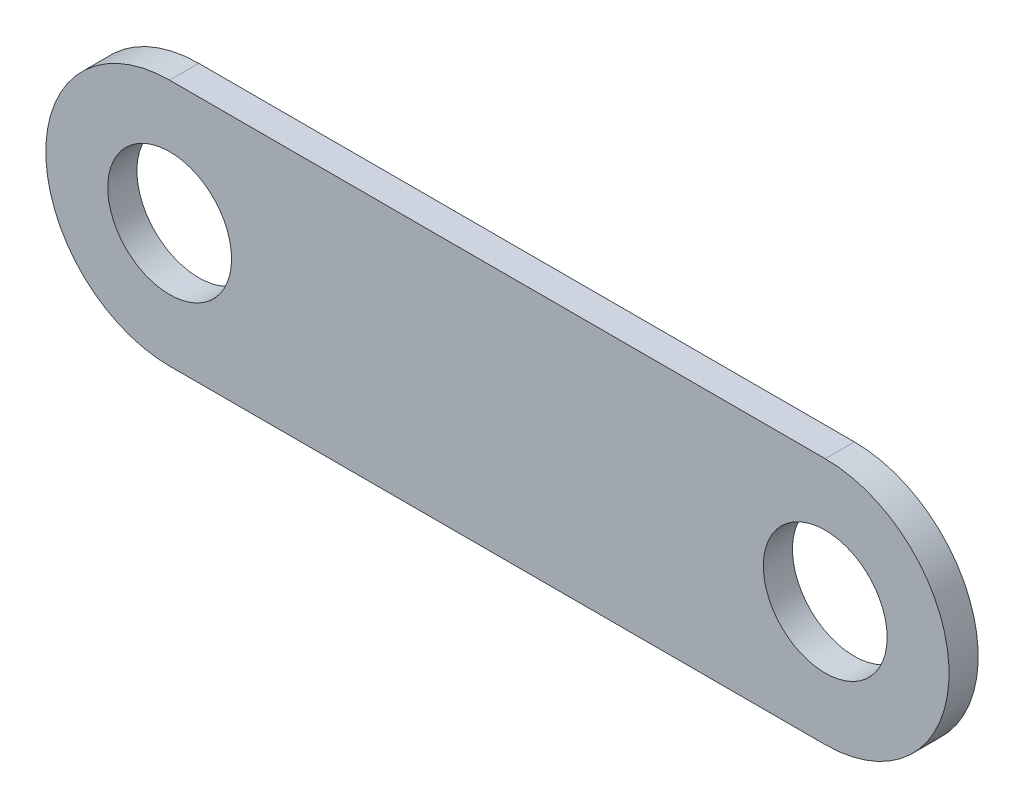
ISO-10303-21;
HEADER;
FILE_DESCRIPTION(('STEP AP214'),'2;1');
FILE_NAME('part.step','',(''),(''),'','','');
FILE_SCHEMA(('AUTOMOTIVE_DESIGN { 1 0 10303 214 1 1 1 1 }'));
ENDSEC;
DATA;
#1=APPLICATION_CONTEXT('core data for automotive mechanical design processes');
#2=APPLICATION_PROTOCOL_DEFINITION('international standard','automotive_design',2000,#1);
#3=PRODUCT_CONTEXT('',#1,'mechanical');
#4=PRODUCT('Part','Part','',(#3));
#5=PRODUCT_RELATED_PRODUCT_CATEGORY('part','',(#4));
#6=PRODUCT_DEFINITION_FORMATION('','',#4);
#7=PRODUCT_DEFINITION_CONTEXT('part definition',#1,'design');
#8=PRODUCT_DEFINITION('design','',#6,#7);
#9=PRODUCT_DEFINITION_SHAPE('','',#8);
#10=(LENGTH_UNIT() NAMED_UNIT(*) SI_UNIT(.MILLI.,.METRE.));
#11=(NAMED_UNIT(*) PLANE_ANGLE_UNIT() SI_UNIT($,.RADIAN.));
#12=(NAMED_UNIT(*) SI_UNIT($,.STERADIAN.) SOLID_ANGLE_UNIT());
#13=UNCERTAINTY_MEASURE_WITH_UNIT(LENGTH_MEASURE(1.E-05),#10,'distance_accuracy_value','');
#14=(GEOMETRIC_REPRESENTATION_CONTEXT(3) GLOBAL_UNCERTAINTY_ASSIGNED_CONTEXT((#13)) GLOBAL_UNIT_ASSIGNED_CONTEXT((#10,
#11,#12)) REPRESENTATION_CONTEXT('',''));
#15=CARTESIAN_POINT('',(0.,0.,0.));
#16=DIRECTION('',(0.,0.,1.));
#17=DIRECTION('',(1.,0.,0.));
#18=AXIS2_PLACEMENT_3D('',#15,#16,#17);
#19=CARTESIAN_POINT('',(0.,0.,-2.));
#20=DIRECTION('',(0.,0.,1.));
#21=DIRECTION('',(1.,0.,0.));
#22=AXIS2_PLACEMENT_3D('',#19,#20,#21);
#23=CYLINDRICAL_SURFACE('',#22,8.5);
#24=CARTESIAN_POINT('',(0.,0.,0.));
#25=DIRECTION('',(0.,0.,1.));
#26=DIRECTION('',(1.,0.,0.));
#27=AXIS2_PLACEMENT_3D('',#24,#25,#26);
#28=CIRCLE('',#27,8.5);
#29=CARTESIAN_POINT('',(0.,8.5,0.));
#30=VERTEX_POINT('',#29);
#31=CARTESIAN_POINT('',(0.,-8.5,0.));
#32=VERTEX_POINT('',#31);
#33=EDGE_CURVE('E104',#30,#32,#28,.T.);
#34=ORIENTED_EDGE('',*,*,#33,.F.);
#35=DIRECTION('',(0.,0.,1.));
#36=VECTOR('',#35,1.);
#37=CARTESIAN_POINT('',(0.,8.5,-2.));
#38=LINE('',#37,#36);
#39=CARTESIAN_POINT('',(0.,8.5,-2.));
#40=VERTEX_POINT('',#39);
#41=EDGE_CURVE('E11',#40,#30,#38,.T.);
#42=ORIENTED_EDGE('',*,*,#41,.F.);
#43=CARTESIAN_POINT('',(0.,0.,-2.));
#44=DIRECTION('',(0.,0.,1.));
#45=DIRECTION('',(1.,0.,0.));
#46=AXIS2_PLACEMENT_3D('',#43,#44,#45);
#47=CIRCLE('',#46,8.5);
#48=CARTESIAN_POINT('',(0.,-8.5,-2.));
#49=VERTEX_POINT('',#48);
#50=EDGE_CURVE('E97',#40,#49,#47,.T.);
#51=ORIENTED_EDGE('',*,*,#50,.T.);
#52=DIRECTION('',(0.,0.,1.));
#53=VECTOR('',#52,1.);
#54=CARTESIAN_POINT('',(0.,-8.5,-2.));
#55=LINE('',#54,#53);
#56=EDGE_CURVE('E42',#49,#32,#55,.T.);
#57=ORIENTED_EDGE('',*,*,#56,.T.);
#58=EDGE_LOOP('',(#34,#42,#51,#57));
#59=FACE_BOUND('',#58,.T.);
#60=ADVANCED_FACE('F39',(#59),#23,.T.);
#61=CARTESIAN_POINT('',(0.,8.5,-2.));
#62=DIRECTION('',(0.,1.,0.));
#63=DIRECTION('',(0.,0.,1.));
#64=AXIS2_PLACEMENT_3D('',#61,#62,#63);
#65=PLANE('',#64);
#66=DIRECTION('',(-1.,0.,0.));
#67=VECTOR('',#66,1.);
#68=CARTESIAN_POINT('',(0.,8.5,0.));
#69=LINE('',#68,#67);
#70=CARTESIAN_POINT('',(45.,8.5,0.));
#71=VERTEX_POINT('',#70);
#72=EDGE_CURVE('E99',#71,#30,#69,.T.);
#73=ORIENTED_EDGE('',*,*,#72,.F.);
#74=DIRECTION('',(0.,0.,1.));
#75=VECTOR('',#74,1.);
#76=CARTESIAN_POINT('',(45.,8.5,-2.));
#77=LINE('',#76,#75);
#78=CARTESIAN_POINT('',(45.,8.5,-2.));
#79=VERTEX_POINT('',#78);
#80=EDGE_CURVE('E48',#79,#71,#77,.T.);
#81=ORIENTED_EDGE('',*,*,#80,.F.);
#82=DIRECTION('',(-1.,0.,0.));
#83=VECTOR('',#82,1.);
#84=CARTESIAN_POINT('',(0.,8.5,-2.));
#85=LINE('',#84,#83);
#86=EDGE_CURVE('E94',#79,#40,#85,.T.);
#87=ORIENTED_EDGE('',*,*,#86,.T.);
#88=ORIENTED_EDGE('',*,*,#41,.T.);
#89=EDGE_LOOP('',(#73,#81,#87,#88));
#90=FACE_BOUND('',#89,.T.);
#91=ADVANCED_FACE('F115',(#90),#65,.T.);
#92=CARTESIAN_POINT('',(45.,0.,-2.));
#93=DIRECTION('',(0.,0.,1.));
#94=DIRECTION('',(1.,0.,0.));
#95=AXIS2_PLACEMENT_3D('',#92,#93,#94);
#96=CYLINDRICAL_SURFACE('',#95,8.5);
#97=CARTESIAN_POINT('',(45.,0.,0.));
#98=DIRECTION('',(0.,0.,1.));
#99=DIRECTION('',(1.,0.,0.));
#100=AXIS2_PLACEMENT_3D('',#97,#98,#99);
#101=CIRCLE('',#100,8.5);
#102=CARTESIAN_POINT('',(45.,-8.5,0.));
#103=VERTEX_POINT('',#102);
#104=EDGE_CURVE('E89',#103,#71,#101,.T.);
#105=ORIENTED_EDGE('',*,*,#104,.F.);
#106=DIRECTION('',(0.,0.,1.));
#107=VECTOR('',#106,1.);
#108=CARTESIAN_POINT('',(45.,-8.5,-2.));
#109=LINE('',#108,#107);
#110=CARTESIAN_POINT('',(45.,-8.5,-2.));
#111=VERTEX_POINT('',#110);
#112=EDGE_CURVE('E84',#111,#103,#109,.T.);
#113=ORIENTED_EDGE('',*,*,#112,.F.);
#114=CARTESIAN_POINT('',(45.,0.,-2.));
#115=DIRECTION('',(0.,0.,1.));
#116=DIRECTION('',(1.,0.,0.));
#117=AXIS2_PLACEMENT_3D('',#114,#115,#116);
#118=CIRCLE('',#117,8.5);
#119=EDGE_CURVE('E87',#111,#79,#118,.T.);
#120=ORIENTED_EDGE('',*,*,#119,.T.);
#121=ORIENTED_EDGE('',*,*,#80,.T.);
#122=EDGE_LOOP('',(#105,#113,#120,#121));
#123=FACE_BOUND('',#122,.T.);
#124=ADVANCED_FACE('F86',(#123),#96,.T.);
#125=CARTESIAN_POINT('',(0.,-8.5,-2.));
#126=DIRECTION('',(0.,-1.,0.));
#127=DIRECTION('',(0.,0.,-1.));
#128=AXIS2_PLACEMENT_3D('',#125,#126,#127);
#129=PLANE('',#128);
#130=DIRECTION('',(1.,0.,0.));
#131=VECTOR('',#130,1.);
#132=CARTESIAN_POINT('',(0.,-8.5,0.));
#133=LINE('',#132,#131);
#134=EDGE_CURVE('E107',#32,#103,#133,.T.);
#135=ORIENTED_EDGE('',*,*,#134,.F.);
#136=ORIENTED_EDGE('',*,*,#56,.F.);
#137=DIRECTION('',(1.,0.,0.));
#138=VECTOR('',#137,1.);
#139=CARTESIAN_POINT('',(0.,-8.5,-2.));
#140=LINE('',#139,#138);
#141=EDGE_CURVE('E93',#49,#111,#140,.T.);
#142=ORIENTED_EDGE('',*,*,#141,.T.);
#143=ORIENTED_EDGE('',*,*,#112,.T.);
#144=EDGE_LOOP('',(#135,#136,#142,#143));
#145=FACE_BOUND('',#144,.T.);
#146=ADVANCED_FACE('F96',(#145),#129,.T.);
#147=CARTESIAN_POINT('',(0.,0.,-2.));
#148=DIRECTION('',(0.,0.,1.));
#149=DIRECTION('',(1.,0.,0.));
#150=AXIS2_PLACEMENT_3D('',#147,#148,#149);
#151=PLANE('',#150);
#152=CARTESIAN_POINT('',(45.,0.,-2.));
#153=DIRECTION('',(0.,0.,1.));
#154=DIRECTION('',(1.,0.,0.));
#155=AXIS2_PLACEMENT_3D('',#152,#153,#154);
#156=CIRCLE('',#155,4.25000000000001);
#157=CARTESIAN_POINT('',(49.25,0.,-2.));
#158=VERTEX_POINT('',#157);
#159=EDGE_CURVE('E148',#158,#158,#156,.T.);
#160=ORIENTED_EDGE('',*,*,#159,.T.);
#161=EDGE_LOOP('',(#160));
#162=FACE_BOUND('',#161,.T.);
#163=CARTESIAN_POINT('',(0.,0.,-2.));
#164=DIRECTION('',(0.,0.,1.));
#165=DIRECTION('',(1.,0.,0.));
#166=AXIS2_PLACEMENT_3D('',#163,#164,#165);
#167=CIRCLE('',#166,4.25);
#168=CARTESIAN_POINT('',(4.25,0.,-2.));
#169=VERTEX_POINT('',#168);
#170=EDGE_CURVE('E108',#169,#169,#167,.T.);
#171=ORIENTED_EDGE('',*,*,#170,.T.);
#172=EDGE_LOOP('',(#171));
#173=FACE_BOUND('',#172,.T.);
#174=ORIENTED_EDGE('',*,*,#50,.F.);
#175=ORIENTED_EDGE('',*,*,#86,.F.);
#176=ORIENTED_EDGE('',*,*,#119,.F.);
#177=ORIENTED_EDGE('',*,*,#141,.F.);
#178=EDGE_LOOP('',(#174,#175,#176,#177));
#179=FACE_BOUND('',#178,.T.);
#180=ADVANCED_FACE('F92',(#162,#173,#179),#151,.F.);
#181=CARTESIAN_POINT('',(0.,0.,0.));
#182=DIRECTION('',(0.,0.,1.));
#183=DIRECTION('',(1.,0.,0.));
#184=AXIS2_PLACEMENT_3D('',#181,#182,#183);
#185=PLANE('',#184);
#186=CARTESIAN_POINT('',(45.,0.,0.));
#187=DIRECTION('',(0.,0.,1.));
#188=DIRECTION('',(1.,0.,0.));
#189=AXIS2_PLACEMENT_3D('',#186,#187,#188);
#190=CIRCLE('',#189,4.25000000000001);
#191=CARTESIAN_POINT('',(49.25,0.,0.));
#192=VERTEX_POINT('',#191);
#193=EDGE_CURVE('E151',#192,#192,#190,.T.);
#194=ORIENTED_EDGE('',*,*,#193,.F.);
#195=EDGE_LOOP('',(#194));
#196=FACE_BOUND('',#195,.T.);
#197=CARTESIAN_POINT('',(0.,0.,0.));
#198=DIRECTION('',(0.,0.,1.));
#199=DIRECTION('',(1.,0.,0.));
#200=AXIS2_PLACEMENT_3D('',#197,#198,#199);
#201=CIRCLE('',#200,4.25);
#202=CARTESIAN_POINT('',(4.25,0.,0.));
#203=VERTEX_POINT('',#202);
#204=EDGE_CURVE('E153',#203,#203,#201,.T.);
#205=ORIENTED_EDGE('',*,*,#204,.F.);
#206=EDGE_LOOP('',(#205));
#207=FACE_BOUND('',#206,.T.);
#208=ORIENTED_EDGE('',*,*,#33,.T.);
#209=ORIENTED_EDGE('',*,*,#134,.T.);
#210=ORIENTED_EDGE('',*,*,#104,.T.);
#211=ORIENTED_EDGE('',*,*,#72,.T.);
#212=EDGE_LOOP('',(#208,#209,#210,#211));
#213=FACE_BOUND('',#212,.T.);
#214=ADVANCED_FACE('F114',(#196,#207,#213),#185,.T.);
#215=CARTESIAN_POINT('',(0.,0.,-2.));
#216=DIRECTION('',(0.,0.,1.));
#217=DIRECTION('',(1.,0.,0.));
#218=AXIS2_PLACEMENT_3D('',#215,#216,#217);
#219=CYLINDRICAL_SURFACE('',#218,4.25);
#220=ORIENTED_EDGE('',*,*,#170,.F.);
#221=EDGE_LOOP('',(#220));
#222=FACE_BOUND('',#221,.T.);
#223=ORIENTED_EDGE('',*,*,#204,.T.);
#224=EDGE_LOOP('',(#223));
#225=FACE_BOUND('',#224,.T.);
#226=ADVANCED_FACE('F133',(#222,#225),#219,.F.);
#227=CARTESIAN_POINT('',(45.,0.,-2.));
#228=DIRECTION('',(0.,0.,1.));
#229=DIRECTION('',(1.,0.,0.));
#230=AXIS2_PLACEMENT_3D('',#227,#228,#229);
#231=CYLINDRICAL_SURFACE('',#230,4.25000000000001);
#232=ORIENTED_EDGE('',*,*,#159,.F.);
#233=EDGE_LOOP('',(#232));
#234=FACE_BOUND('',#233,.T.);
#235=ORIENTED_EDGE('',*,*,#193,.T.);
#236=EDGE_LOOP('',(#235));
#237=FACE_BOUND('',#236,.T.);
#238=ADVANCED_FACE('F140',(#234,#237),#231,.F.);
#239=CLOSED_SHELL('',(#60,#91,#124,#146,#180,#214,#226,#238));
#240=MANIFOLD_SOLID_BREP('B2',#239);
#241=ADVANCED_BREP_SHAPE_REPRESENTATION('',(#18,#240),#14);
#242=SHAPE_DEFINITION_REPRESENTATION(#9,#241);
ENDSEC;
END-ISO-10303-21;
